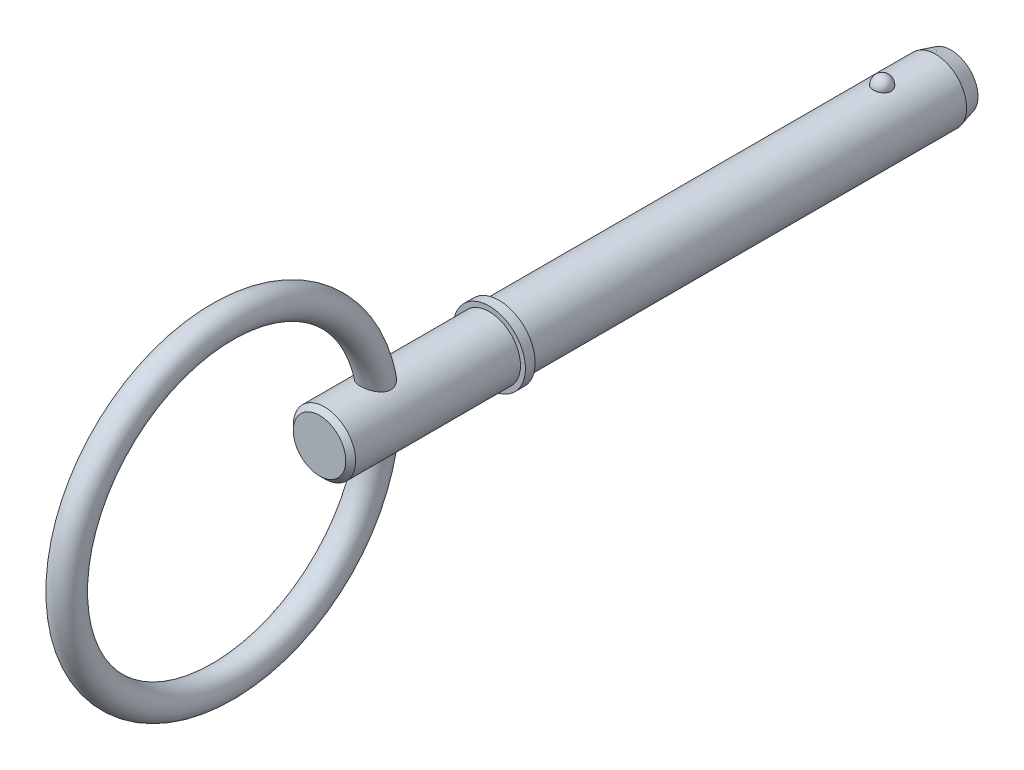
ISO-10303-21;
HEADER;
FILE_DESCRIPTION(('STEP AP214'),'2;1');
FILE_NAME('part.step','',(''),(''),'','','');
FILE_SCHEMA(('AUTOMOTIVE_DESIGN { 1 0 10303 214 1 1 1 1 }'));
ENDSEC;
DATA;
#1=APPLICATION_CONTEXT('core data for automotive mechanical design processes');
#2=APPLICATION_PROTOCOL_DEFINITION('international standard','automotive_design',2000,#1);
#3=PRODUCT_CONTEXT('',#1,'mechanical');
#4=PRODUCT('Part','Part','',(#3));
#5=PRODUCT_RELATED_PRODUCT_CATEGORY('part','',(#4));
#6=PRODUCT_DEFINITION_FORMATION('','',#4);
#7=PRODUCT_DEFINITION_CONTEXT('part definition',#1,'design');
#8=PRODUCT_DEFINITION('design','',#6,#7);
#9=PRODUCT_DEFINITION_SHAPE('','',#8);
#10=(LENGTH_UNIT() NAMED_UNIT(*) SI_UNIT(.MILLI.,.METRE.));
#11=(NAMED_UNIT(*) PLANE_ANGLE_UNIT() SI_UNIT($,.RADIAN.));
#12=(NAMED_UNIT(*) SI_UNIT($,.STERADIAN.) SOLID_ANGLE_UNIT());
#13=UNCERTAINTY_MEASURE_WITH_UNIT(LENGTH_MEASURE(1.E-05),#10,'distance_accuracy_value','');
#14=(GEOMETRIC_REPRESENTATION_CONTEXT(3) GLOBAL_UNCERTAINTY_ASSIGNED_CONTEXT((#13)) GLOBAL_UNIT_ASSIGNED_CONTEXT((#10,
#11,#12)) REPRESENTATION_CONTEXT('',''));
#15=CARTESIAN_POINT('',(0.,0.,0.));
#16=DIRECTION('',(0.,0.,1.));
#17=DIRECTION('',(1.,0.,0.));
#18=AXIS2_PLACEMENT_3D('',#15,#16,#17);
#19=CARTESIAN_POINT('',(0.,0.,38.1));
#20=DIRECTION('',(0.,0.,-1.));
#21=DIRECTION('',(-1.,0.,0.));
#22=AXIS2_PLACEMENT_3D('',#19,#20,#21);
#23=CYLINDRICAL_SURFACE('',#22,3.175);
#24=CARTESIAN_POINT('',(0.90060722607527,3.0445905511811,-0.910000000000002));
#25=CARTESIAN_POINT('',(0.90060646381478,3.04459122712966,-0.859144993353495));
#26=CARTESIAN_POINT('',(0.896466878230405,3.04582460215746,-0.808280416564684));
#27=CARTESIAN_POINT('',(0.88000740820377,3.05062019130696,-0.707994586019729));
#28=CARTESIAN_POINT('',(0.86768478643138,3.05418318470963,-0.65857382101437));
#29=CARTESIAN_POINT('',(0.835170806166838,3.06323316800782,-0.562604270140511));
#30=CARTESIAN_POINT('',(0.81498289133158,3.0687193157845,-0.516054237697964));
#31=CARTESIAN_POINT('',(0.767236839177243,3.08100268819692,-0.427093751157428));
#32=CARTESIAN_POINT('',(0.739678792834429,3.08779989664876,-0.384683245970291));
#33=CARTESIAN_POINT('',(0.677715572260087,3.10198953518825,-0.304951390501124));
#34=CARTESIAN_POINT('',(0.643275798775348,3.10938485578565,-0.267657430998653));
#35=CARTESIAN_POINT('',(0.568522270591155,3.12391647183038,-0.199446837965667));
#36=CARTESIAN_POINT('',(0.528208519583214,3.13105276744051,-0.168530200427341));
#37=CARTESIAN_POINT('',(0.442911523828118,3.14425008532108,-0.114021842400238));
#38=CARTESIAN_POINT('',(0.397942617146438,3.15031426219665,-0.0904084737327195));
#39=CARTESIAN_POINT('',(0.304493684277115,3.16071443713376,-0.0510610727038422));
#40=CARTESIAN_POINT('',(0.256014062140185,3.1650506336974,-0.0353261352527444));
#41=CARTESIAN_POINT('',(0.15789136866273,3.17144549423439,-0.012415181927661));
#42=CARTESIAN_POINT('',(0.108287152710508,3.1735453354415,-0.00508422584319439));
#43=CARTESIAN_POINT('',(0.00850701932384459,3.17538048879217,0.00133254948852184));
#44=CARTESIAN_POINT('',(-0.0416688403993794,3.17511603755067,0.00041919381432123));
#45=CARTESIAN_POINT('',(-0.140377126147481,3.17227395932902,-0.00954840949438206));
#46=CARTESIAN_POINT('',(-0.188922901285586,3.16973088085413,-0.0184810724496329));
#47=CARTESIAN_POINT('',(-0.283780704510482,3.16265029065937,-0.0440659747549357));
#48=CARTESIAN_POINT('',(-0.33009269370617,3.15811274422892,-0.060718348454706));
#49=CARTESIAN_POINT('',(-0.419493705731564,3.1474895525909,-0.101406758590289));
#50=CARTESIAN_POINT('',(-0.462561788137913,3.14139480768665,-0.125486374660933));
#51=CARTESIAN_POINT('',(-0.544042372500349,3.12831396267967,-0.180346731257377));
#52=CARTESIAN_POINT('',(-0.582454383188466,3.12132776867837,-0.211128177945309));
#53=CARTESIAN_POINT('',(-0.65437109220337,3.10705591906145,-0.279257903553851));
#54=CARTESIAN_POINT('',(-0.68776300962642,3.09976707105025,-0.316724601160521));
#55=CARTESIAN_POINT('',(-0.747869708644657,3.08581767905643,-0.396782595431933));
#56=CARTESIAN_POINT('',(-0.774583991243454,3.07915718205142,-0.439374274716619));
#57=CARTESIAN_POINT('',(-0.820959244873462,3.06712152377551,-0.529074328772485));
#58=CARTESIAN_POINT('',(-0.840531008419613,3.06176288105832,-0.576231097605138));
#59=CARTESIAN_POINT('',(-0.871672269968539,3.0530437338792,-0.673291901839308));
#60=CARTESIAN_POINT('',(-0.883242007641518,3.04968316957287,-0.723195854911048));
#61=CARTESIAN_POINT('',(-0.898057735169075,3.04535343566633,-0.824104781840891));
#62=CARTESIAN_POINT('',(-0.901339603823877,3.04437395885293,-0.875104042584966));
#63=CARTESIAN_POINT('',(-0.89960137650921,3.04488803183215,-0.976947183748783));
#64=CARTESIAN_POINT('',(-0.894581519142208,3.04638151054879,-1.02779106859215));
#65=CARTESIAN_POINT('',(-0.876414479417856,3.051656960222,-1.12760218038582));
#66=CARTESIAN_POINT('',(-0.863310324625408,3.05542681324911,-1.17657789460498));
#67=CARTESIAN_POINT('',(-0.829334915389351,3.06482253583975,-1.27156757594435));
#68=CARTESIAN_POINT('',(-0.808463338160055,3.07044848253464,-1.31758141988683));
#69=CARTESIAN_POINT('',(-0.75932502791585,3.08296842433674,-1.40563218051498));
#70=CARTESIAN_POINT('',(-0.731017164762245,3.08986940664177,-1.44764515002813));
#71=CARTESIAN_POINT('',(-0.667767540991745,3.10415201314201,-1.52624913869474));
#72=CARTESIAN_POINT('',(-0.632825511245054,3.11153365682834,-1.56283993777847));
#73=CARTESIAN_POINT('',(-0.557049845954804,3.12598962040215,-1.62972906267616));
#74=CARTESIAN_POINT('',(-0.51619336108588,3.13306260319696,-1.66000181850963));
#75=CARTESIAN_POINT('',(-0.429792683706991,3.14607829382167,-1.7132172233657));
#76=CARTESIAN_POINT('',(-0.384248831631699,3.15202108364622,-1.73616040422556));
#77=CARTESIAN_POINT('',(-0.290370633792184,3.16204171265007,-1.77380927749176));
#78=CARTESIAN_POINT('',(-0.242079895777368,3.16614263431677,-1.7886174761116));
#79=CARTESIAN_POINT('',(-0.143579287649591,3.17213528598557,-1.81001390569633));
#80=CARTESIAN_POINT('',(-0.0933696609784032,3.1740272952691,-1.81660317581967));
#81=CARTESIAN_POINT('',(0.00648182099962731,3.17537830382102,-1.82132177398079));
#82=CARTESIAN_POINT('',(0.0561153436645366,3.17488455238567,-1.81961539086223));
#83=CARTESIAN_POINT('',(0.154368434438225,3.1716260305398,-1.80816900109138));
#84=CARTESIAN_POINT('',(0.202988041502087,3.16886134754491,-1.79842930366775));
#85=CARTESIAN_POINT('',(0.297642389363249,3.16137318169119,-1.77125024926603));
#86=CARTESIAN_POINT('',(0.343686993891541,3.15665785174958,-1.75384292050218));
#87=CARTESIAN_POINT('',(0.432167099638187,3.14576631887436,-1.71181408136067));
#88=CARTESIAN_POINT('',(0.474602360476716,3.13959001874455,-1.68719209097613));
#89=CARTESIAN_POINT('',(0.555408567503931,3.1263159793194,-1.63094218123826));
#90=CARTESIAN_POINT('',(0.593703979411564,3.11920512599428,-1.59920888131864));
#91=CARTESIAN_POINT('',(0.664472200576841,3.10490064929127,-1.52981493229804));
#92=CARTESIAN_POINT('',(0.696944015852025,3.09770701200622,-1.49215327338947));
#93=CARTESIAN_POINT('',(0.755798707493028,3.08388169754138,-1.41116434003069));
#94=CARTESIAN_POINT('',(0.782059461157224,3.07726269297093,-1.36774610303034));
#95=CARTESIAN_POINT('',(0.827051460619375,3.06547790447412,-1.27699966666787));
#96=CARTESIAN_POINT('',(0.845785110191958,3.06031165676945,-1.22967272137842));
#97=CARTESIAN_POINT('',(0.873798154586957,3.05242388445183,-1.13728658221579));
#98=CARTESIAN_POINT('',(0.883833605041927,3.04951005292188,-1.09247132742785));
#99=CARTESIAN_POINT('',(0.897238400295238,3.0455931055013,-1.00177329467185));
#100=CARTESIAN_POINT('',(0.900607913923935,3.0445899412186,-0.955890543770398));
#101=CARTESIAN_POINT('',(0.90060722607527,3.0445905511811,-0.910000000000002));
#102=B_SPLINE_CURVE_WITH_KNOTS('',3,(#24,#25,#26,#27,#28,#29,#30,#31,#32,#33,#34,#35,#36,#37,
#38,#39,#40,#41,#42,#43,#44,#45,#46,#47,#48,#49,#50,#51,#52,#53,#54,#55,#56,#57,#58,#59,#60,#61,
#62,#63,#64,#65,#66,#67,#68,#69,#70,#71,#72,#73,#74,#75,#76,#77,#78,#79,#80,#81,#82,#83,#84,#85,
#86,#87,#88,#89,#90,#91,#92,#93,#94,#95,#96,#97,#98,#99,#100,#101),.UNSPECIFIED.,.T.,.F.,(4,2,2,
2,2,2,2,2,2,2,2,2,2,2,2,2,2,2,2,2,2,2,2,2,2,2,2,2,2,2,2,2,2,2,2,2,2,2,4),(0.,0.152400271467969,
0.304851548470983,0.457236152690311,0.609618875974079,0.762787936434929,0.9159569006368,
1.06866739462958,1.22136034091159,1.37119044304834,1.52100555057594,1.66858689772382,
1.81617081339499,1.9646377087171,2.1131202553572,2.26455561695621,2.41600229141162,
2.5692805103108,2.72255413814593,2.87516308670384,3.02776764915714,3.1795669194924,
3.33137249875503,3.48403607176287,3.63670583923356,3.78998198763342,3.94324701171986,
4.09453370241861,4.24580126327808,4.39408543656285,4.5423639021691,4.69002878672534,
4.83770349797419,4.9877312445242,5.13778457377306,5.29058018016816,5.44332695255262,
5.58085340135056,5.71837636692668),.UNSPECIFIED.);
#103=CARTESIAN_POINT('',(0.90060722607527,3.0445905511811,-0.910000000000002));
#104=VERTEX_POINT('',#103);
#105=EDGE_CURVE('E102',#104,#104,#102,.T.);
#106=ORIENTED_EDGE('',*,*,#105,.T.);
#107=EDGE_LOOP('',(#106));
#108=FACE_BOUND('',#107,.T.);
#109=CARTESIAN_POINT('',(0.,0.,-6.33400000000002));
#110=DIRECTION('',(0.,0.,-1.));
#111=DIRECTION('',(-1.,0.,0.));
#112=AXIS2_PLACEMENT_3D('',#109,#110,#111);
#113=CIRCLE('',#112,3.175);
#114=CARTESIAN_POINT('',(3.175,0.,-6.33400000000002));
#115=VERTEX_POINT('',#114);
#116=EDGE_CURVE('E109',#115,#115,#113,.F.);
#117=ORIENTED_EDGE('',*,*,#116,.T.);
#118=EDGE_LOOP('',(#117));
#119=FACE_BOUND('',#118,.T.);
#120=CARTESIAN_POINT('',(0.,0.,38.1));
#121=DIRECTION('',(0.,0.,1.));
#122=DIRECTION('',(1.,0.,0.));
#123=AXIS2_PLACEMENT_3D('',#120,#121,#122);
#124=CIRCLE('',#123,3.175);
#125=CARTESIAN_POINT('',(3.175,0.,38.1));
#126=VERTEX_POINT('',#125);
#127=EDGE_CURVE('E107',#126,#126,#124,.T.);
#128=ORIENTED_EDGE('',*,*,#127,.F.);
#129=EDGE_LOOP('',(#128));
#130=FACE_BOUND('',#129,.T.);
#131=ADVANCED_FACE('F39',(#108,#119,#130),#23,.T.);
#132=CARTESIAN_POINT('',(0.,0.,-7.92));
#133=DIRECTION('',(0.,0.,-1.));
#134=DIRECTION('',(-1.,0.,0.));
#135=AXIS2_PLACEMENT_3D('',#132,#133,#134);
#136=PLANE('',#135);
#137=CARTESIAN_POINT('',(0.,0.,-7.92));
#138=DIRECTION('',(0.,0.,-1.));
#139=DIRECTION('',(-1.,0.,0.));
#140=AXIS2_PLACEMENT_3D('',#137,#138,#139);
#141=CIRCLE('',#140,2.75003258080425);
#142=CARTESIAN_POINT('',(2.75003258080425,0.,-7.92));
#143=VERTEX_POINT('',#142);
#144=EDGE_CURVE('E143',#143,#143,#141,.T.);
#145=ORIENTED_EDGE('',*,*,#144,.T.);
#146=EDGE_LOOP('',(#145));
#147=FACE_BOUND('',#146,.T.);
#148=ADVANCED_FACE('F88',(#147),#136,.T.);
#149=CARTESIAN_POINT('',(0.,0.,-7.92));
#150=DIRECTION('',(0.,0.,1.));
#151=DIRECTION('',(1.,0.,0.));
#152=AXIS2_PLACEMENT_3D('',#149,#150,#151);
#153=CONICAL_SURFACE('',#152,2.75003258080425,0.26179938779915);
#154=CARTESIAN_POINT('',(3.175,0.,-6.33400000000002));
#155=CARTESIAN_POINT('',(3.17057325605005,0.,-6.35052083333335));
#156=CARTESIAN_POINT('',(3.16614651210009,0.,-6.36704166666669));
#157=CARTESIAN_POINT('',(3.15729302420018,0.,-6.40008333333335));
#158=CARTESIAN_POINT('',(3.15286628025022,0.,-6.41660416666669));
#159=CARTESIAN_POINT('',(3.14401279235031,0.,-6.44964583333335));
#160=CARTESIAN_POINT('',(3.13958604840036,0.,-6.46616666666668));
#161=CARTESIAN_POINT('',(3.13073256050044,0.,-6.49920833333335));
#162=CARTESIAN_POINT('',(3.12630581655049,0.,-6.51572916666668));
#163=CARTESIAN_POINT('',(3.11745232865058,0.,-6.54877083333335));
#164=CARTESIAN_POINT('',(3.11302558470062,0.,-6.56529166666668));
#165=CARTESIAN_POINT('',(3.10417209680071,0.,-6.59833333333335));
#166=CARTESIAN_POINT('',(3.09974535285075,0.,-6.61485416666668));
#167=CARTESIAN_POINT('',(3.09089186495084,0.,-6.64789583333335));
#168=CARTESIAN_POINT('',(3.08646512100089,0.,-6.66441666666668));
#169=CARTESIAN_POINT('',(3.07761163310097,0.,-6.69745833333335));
#170=CARTESIAN_POINT('',(3.07318488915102,0.,-6.71397916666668));
#171=CARTESIAN_POINT('',(3.06433140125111,0.,-6.74702083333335));
#172=CARTESIAN_POINT('',(3.05990465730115,0.,-6.76354166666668));
#173=CARTESIAN_POINT('',(3.05105116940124,0.,-6.79658333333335));
#174=CARTESIAN_POINT('',(3.04662442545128,0.,-6.81310416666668));
#175=CARTESIAN_POINT('',(3.03777093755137,0.,-6.84614583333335));
#176=CARTESIAN_POINT('',(3.03334419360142,0.,-6.86266666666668));
#177=CARTESIAN_POINT('',(3.0244907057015,0.,-6.89570833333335));
#178=CARTESIAN_POINT('',(3.02006396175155,0.,-6.91222916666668));
#179=CARTESIAN_POINT('',(3.01121047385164,0.,-6.94527083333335));
#180=CARTESIAN_POINT('',(3.00678372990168,0.,-6.96179166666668));
#181=CARTESIAN_POINT('',(2.99793024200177,0.,-6.99483333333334));
#182=CARTESIAN_POINT('',(2.99350349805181,0.,-7.01135416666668));
#183=CARTESIAN_POINT('',(2.9846500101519,0.,-7.04439583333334));
#184=CARTESIAN_POINT('',(2.98022326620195,0.,-7.06091666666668));
#185=CARTESIAN_POINT('',(2.97136977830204,0.,-7.09395833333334));
#186=CARTESIAN_POINT('',(2.96694303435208,0.,-7.11047916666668));
#187=CARTESIAN_POINT('',(2.95808954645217,0.,-7.14352083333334));
#188=CARTESIAN_POINT('',(2.95366280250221,0.,-7.16004166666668));
#189=CARTESIAN_POINT('',(2.9448093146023,0.,-7.19308333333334));
#190=CARTESIAN_POINT('',(2.94038257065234,0.,-7.20960416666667));
#191=CARTESIAN_POINT('',(2.93152908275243,0.,-7.24264583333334));
#192=CARTESIAN_POINT('',(2.92710233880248,0.,-7.25916666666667));
#193=CARTESIAN_POINT('',(2.91824885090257,0.,-7.29220833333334));
#194=CARTESIAN_POINT('',(2.91382210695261,0.,-7.30872916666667));
#195=CARTESIAN_POINT('',(2.9049686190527,0.,-7.34177083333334));
#196=CARTESIAN_POINT('',(2.90054187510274,0.,-7.35829166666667));
#197=CARTESIAN_POINT('',(2.89168838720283,0.,-7.39133333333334));
#198=CARTESIAN_POINT('',(2.88726164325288,0.,-7.40785416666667));
#199=CARTESIAN_POINT('',(2.87840815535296,0.,-7.44089583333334));
#200=CARTESIAN_POINT('',(2.87398141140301,0.,-7.45741666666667));
#201=CARTESIAN_POINT('',(2.8651279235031,0.,-7.49045833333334));
#202=CARTESIAN_POINT('',(2.86070117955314,0.,-7.50697916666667));
#203=CARTESIAN_POINT('',(2.85184769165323,0.,-7.54002083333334));
#204=CARTESIAN_POINT('',(2.84742094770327,0.,-7.55654166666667));
#205=CARTESIAN_POINT('',(2.83856745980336,0.,-7.58958333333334));
#206=CARTESIAN_POINT('',(2.83414071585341,0.,-7.60610416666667));
#207=CARTESIAN_POINT('',(2.82528722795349,0.,-7.63914583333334));
#208=CARTESIAN_POINT('',(2.82086048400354,0.,-7.65566666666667));
#209=CARTESIAN_POINT('',(2.81200699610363,0.,-7.68870833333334));
#210=CARTESIAN_POINT('',(2.80758025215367,0.,-7.70522916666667));
#211=CARTESIAN_POINT('',(2.79872676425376,0.,-7.73827083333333));
#212=CARTESIAN_POINT('',(2.7943000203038,0.,-7.75479166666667));
#213=CARTESIAN_POINT('',(2.78544653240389,0.,-7.78783333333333));
#214=CARTESIAN_POINT('',(2.78101978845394,0.,-7.80435416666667));
#215=CARTESIAN_POINT('',(2.77216630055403,0.,-7.83739583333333));
#216=CARTESIAN_POINT('',(2.76773955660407,0.,-7.85391666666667));
#217=CARTESIAN_POINT('',(2.75888606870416,0.,-7.88695833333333));
#218=CARTESIAN_POINT('',(2.7544593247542,0.,-7.90347916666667));
#219=CARTESIAN_POINT('',(2.75003258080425,0.,-7.92));
#220=B_SPLINE_CURVE_WITH_KNOTS('',3,(#154,#155,#156,#157,#158,#159,#160,#161,#162,#163,#164,
#165,#166,#167,#168,#169,#170,#171,#172,#173,#174,#175,#176,#177,#178,#179,#180,#181,#182,#183,
#184,#185,#186,#187,#188,#189,#190,#191,#192,#193,#194,#195,#196,#197,#198,#199,#200,#201,#202,
#203,#204,#205,#206,#207,#208,#209,#210,#211,#212,#213,#214,#215,#216,#217,#218,#219),
.UNSPECIFIED.,.F.,.F.,(4,2,2,2,2,2,2,2,2,2,2,2,2,2,2,2,2,2,2,2,2,2,2,2,2,2,2,2,2,2,2,2,4),(0.,
0.051310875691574,0.102621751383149,0.153932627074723,0.205243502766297,0.256554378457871,
0.307865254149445,0.359176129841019,0.410487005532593,0.461797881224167,0.513108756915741,
0.564419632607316,0.61573050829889,0.667041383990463,0.718352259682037,0.769663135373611,
0.820974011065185,0.872284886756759,0.923595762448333,0.974906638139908,1.02621751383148,
1.07752838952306,1.12883926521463,1.1801501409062,1.23146101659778,1.28277189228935,
1.33408276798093,1.3853936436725,1.43670451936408,1.48801539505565,1.53932627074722,
1.5906371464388,1.64194802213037),.UNSPECIFIED.);
#221=EDGE_CURVE('BSEAM94',#115,#143,#220,.T.);
#222=ORIENTED_EDGE('',*,*,#116,.F.);
#223=ORIENTED_EDGE('',*,*,#144,.F.);
#224=ORIENTED_EDGE('',*,*,#221,.T.);
#225=ORIENTED_EDGE('',*,*,#221,.F.);
#226=EDGE_LOOP('',(#222,#224,#223,#225));
#227=FACE_BOUND('',#226,.T.);
#228=ADVANCED_FACE('F94',(#227),#153,.T.);
#229=CARTESIAN_POINT('',(0.,3.175,-0.910000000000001));
#230=DIRECTION('',(0.,1.,0.));
#231=DIRECTION('',(0.,0.,-1.));
#232=AXIS2_PLACEMENT_3D('',#229,#230,#231);
#233=SPHERICAL_SURFACE('',#232,0.91);
#234=ORIENTED_EDGE('',*,*,#105,.F.);
#235=EDGE_LOOP('',(#234));
#236=FACE_BOUND('',#235,.T.);
#237=ADVANCED_FACE('F112',(#236),#233,.T.);
#238=CARTESIAN_POINT('',(0.,0.,38.1));
#239=DIRECTION('',(0.,0.,-1.));
#240=DIRECTION('',(-1.,0.,0.));
#241=AXIS2_PLACEMENT_3D('',#238,#239,#240);
#242=PLANE('',#241);
#243=ORIENTED_EDGE('',*,*,#127,.T.);
#244=EDGE_LOOP('',(#243));
#245=FACE_BOUND('',#244,.T.);
#246=CARTESIAN_POINT('',(0.,0.,38.1));
#247=DIRECTION('',(0.,0.,-1.));
#248=DIRECTION('',(-1.,0.,0.));
#249=AXIS2_PLACEMENT_3D('',#246,#247,#248);
#250=CIRCLE('',#249,3.675);
#251=CARTESIAN_POINT('',(-3.675,0.,38.1));
#252=VERTEX_POINT('',#251);
#253=EDGE_CURVE('E108',#252,#252,#250,.T.);
#254=ORIENTED_EDGE('',*,*,#253,.T.);
#255=EDGE_LOOP('',(#254));
#256=FACE_BOUND('',#255,.T.);
#257=ADVANCED_FACE('F116',(#245,#256),#242,.T.);
#258=CARTESIAN_POINT('',(0.,0.,33.7287874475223));
#259=DIRECTION('',(0.,0.,-1.));
#260=DIRECTION('',(-1.,0.,0.));
#261=AXIS2_PLACEMENT_3D('',#258,#259,#260);
#262=CYLINDRICAL_SURFACE('',#261,3.675);
#263=CARTESIAN_POINT('',(0.,0.,39.1));
#264=DIRECTION('',(0.,0.,-1.));
#265=DIRECTION('',(-1.,0.,0.));
#266=AXIS2_PLACEMENT_3D('',#263,#264,#265);
#267=CIRCLE('',#266,3.675);
#268=CARTESIAN_POINT('',(-3.675,0.,39.1));
#269=VERTEX_POINT('',#268);
#270=EDGE_CURVE('E133',#269,#269,#267,.T.);
#271=ORIENTED_EDGE('',*,*,#270,.T.);
#272=EDGE_LOOP('',(#271));
#273=FACE_BOUND('',#272,.T.);
#274=ORIENTED_EDGE('',*,*,#253,.F.);
#275=EDGE_LOOP('',(#274));
#276=FACE_BOUND('',#275,.T.);
#277=ADVANCED_FACE('F120',(#273,#276),#262,.T.);
#278=CARTESIAN_POINT('',(0.,3.675,39.1));
#279=DIRECTION('',(0.,0.,1.));
#280=DIRECTION('',(1.,0.,0.));
#281=AXIS2_PLACEMENT_3D('',#278,#279,#280);
#282=PLANE('',#281);
#283=CARTESIAN_POINT('',(0.,0.,39.1));
#284=DIRECTION('',(0.,0.,1.));
#285=DIRECTION('',(1.,0.,0.));
#286=AXIS2_PLACEMENT_3D('',#283,#284,#285);
#287=CIRCLE('',#286,3.175);
#288=CARTESIAN_POINT('',(3.175,0.,39.1));
#289=VERTEX_POINT('',#288);
#290=EDGE_CURVE('E111',#289,#289,#287,.T.);
#291=ORIENTED_EDGE('',*,*,#290,.F.);
#292=EDGE_LOOP('',(#291));
#293=FACE_BOUND('',#292,.T.);
#294=ORIENTED_EDGE('',*,*,#270,.F.);
#295=EDGE_LOOP('',(#294));
#296=FACE_BOUND('',#295,.T.);
#297=ADVANCED_FACE('F85',(#293,#296),#282,.T.);
#298=CARTESIAN_POINT('',(0.,0.,56.39));
#299=DIRECTION('',(0.,0.,-1.));
#300=DIRECTION('',(-1.,0.,0.));
#301=AXIS2_PLACEMENT_3D('',#298,#299,#300);
#302=CYLINDRICAL_SURFACE('',#301,3.175);
#303=CARTESIAN_POINT('',(-0.793622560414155,-3.07421343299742,49.3949618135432));
#304=CARTESIAN_POINT('',(-0.723928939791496,-3.09220199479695,49.3540743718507));
#305=CARTESIAN_POINT('',(-0.65053758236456,-3.10860299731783,49.3186572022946));
#306=CARTESIAN_POINT('',(-0.498225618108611,-3.13662262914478,49.25960803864));
#307=CARTESIAN_POINT('',(-0.41929921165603,-3.14823615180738,49.235988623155));
#308=CARTESIAN_POINT('',(-0.258022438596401,-3.16553731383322,49.2011787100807));
#309=CARTESIAN_POINT('',(-0.175668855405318,-3.17121924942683,49.1900001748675));
#310=CARTESIAN_POINT('',(-0.0100583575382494,-3.17606405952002,49.1804538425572));
#311=CARTESIAN_POINT('',(0.0731982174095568,-3.17522930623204,49.1820813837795));
#312=CARTESIAN_POINT('',(0.236345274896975,-3.16722178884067,49.1979075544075));
#313=CARTESIAN_POINT('',(0.31626956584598,-3.16018772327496,49.2118310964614));
#314=CARTESIAN_POINT('',(0.472429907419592,-3.14064183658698,49.2514871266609));
#315=CARTESIAN_POINT('',(0.548665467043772,-3.12812928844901,49.2772211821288));
#316=CARTESIAN_POINT('',(0.696533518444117,-3.0985857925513,49.3403145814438));
#317=CARTESIAN_POINT('',(0.768085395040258,-3.08149328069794,49.3778336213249));
#318=CARTESIAN_POINT('',(0.903666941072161,-3.04449595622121,49.463584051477));
#319=CARTESIAN_POINT('',(0.967693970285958,-3.02459016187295,49.5118191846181));
#320=CARTESIAN_POINT('',(1.08889306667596,-2.98315111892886,49.620085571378));
#321=CARTESIAN_POINT('',(1.14572430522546,-2.96158491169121,49.6804869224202));
#322=CARTESIAN_POINT('',(1.24806454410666,-2.91993487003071,49.8106874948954));
#323=CARTESIAN_POINT('',(1.29357550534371,-2.89985077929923,49.8804850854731));
#324=CARTESIAN_POINT('',(1.37094214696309,-2.86407549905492,50.0262600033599));
#325=CARTESIAN_POINT('',(1.40307792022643,-2.84829687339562,50.1020662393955));
#326=CARTESIAN_POINT('',(1.45397574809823,-2.82265933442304,50.2589553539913));
#327=CARTESIAN_POINT('',(1.47274938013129,-2.81279529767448,50.3400335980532));
#328=CARTESIAN_POINT('',(1.49549698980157,-2.80076108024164,50.4979026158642));
#329=CARTESIAN_POINT('',(1.50056337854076,-2.79802369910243,50.5744958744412));
#330=CARTESIAN_POINT('',(1.49933665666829,-2.79868066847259,50.7275541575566));
#331=CARTESIAN_POINT('',(1.49304097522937,-2.80207640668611,50.8040191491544));
#332=CARTESIAN_POINT('',(1.46976618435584,-2.81435249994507,50.9552802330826));
#333=CARTESIAN_POINT('',(1.45272287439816,-2.82326580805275,51.0300634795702));
#334=CARTESIAN_POINT('',(1.40884990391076,-2.84541139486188,51.1760088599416));
#335=CARTESIAN_POINT('',(1.38201642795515,-2.85864535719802,51.2471695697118));
#336=CARTESIAN_POINT('',(1.31496449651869,-2.89016475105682,51.3946079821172));
#337=CARTESIAN_POINT('',(1.27338339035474,-2.90890132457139,51.4701693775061));
#338=CARTESIAN_POINT('',(1.17952729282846,-2.94820796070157,51.6139034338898));
#339=CARTESIAN_POINT('',(1.12723913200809,-2.96878026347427,51.6820668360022));
#340=CARTESIAN_POINT('',(1.00570728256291,-3.01228109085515,51.8173106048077));
#341=CARTESIAN_POINT('',(0.935174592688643,-3.03519170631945,51.8832498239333));
#342=CARTESIAN_POINT('',(0.78260575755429,-3.07805054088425,52.001321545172));
#343=CARTESIAN_POINT('',(0.70058894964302,-3.09800362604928,52.0534768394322));
#344=CARTESIAN_POINT('',(0.549003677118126,-3.12787153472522,52.1296423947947));
#345=CARTESIAN_POINT('',(0.481582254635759,-3.1390487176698,52.1574376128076));
#346=CARTESIAN_POINT('',(0.34269622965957,-3.15722518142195,52.2021563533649));
#347=CARTESIAN_POINT('',(0.271235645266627,-3.16422853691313,52.2190904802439));
#348=CARTESIAN_POINT('',(0.125873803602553,-3.17334230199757,52.2410622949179));
#349=CARTESIAN_POINT('',(0.0519637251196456,-3.17543249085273,52.2460508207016));
#350=CARTESIAN_POINT('',(-0.0956207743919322,-3.17441743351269,52.2436180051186));
#351=CARTESIAN_POINT('',(-0.169295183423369,-3.1713119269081,52.2361960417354));
#352=CARTESIAN_POINT('',(-0.30944934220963,-3.1606169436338,52.2103375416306));
#353=CARTESIAN_POINT('',(-0.376089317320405,-3.15332372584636,52.1926279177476));
#354=CARTESIAN_POINT('',(-0.505583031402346,-3.13517004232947,52.1477876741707));
#355=CARTESIAN_POINT('',(-0.568435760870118,-3.12430863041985,52.1206545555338));
#356=CARTESIAN_POINT('',(-0.69430644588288,-3.09887452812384,52.0555626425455));
#357=CARTESIAN_POINT('',(-0.756907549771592,-3.08406907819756,52.0168937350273));
#358=CARTESIAN_POINT('',(-0.8756456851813,-3.05248288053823,51.9313455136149));
#359=CARTESIAN_POINT('',(-0.931779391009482,-3.03570112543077,51.8844620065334));
#360=CARTESIAN_POINT('',(-1.0463923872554,-2.99832170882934,51.7747926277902));
#361=CARTESIAN_POINT('',(-1.10353654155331,-2.97757338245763,51.7106605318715));
#362=CARTESIAN_POINT('',(-1.20755858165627,-2.93692907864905,51.5742268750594));
#363=CARTESIAN_POINT('',(-1.25442453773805,-2.91703411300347,51.5019159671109));
#364=CARTESIAN_POINT('',(-1.34199791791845,-2.87788786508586,51.3412794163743));
#365=CARTESIAN_POINT('',(-1.38127718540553,-2.8590047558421,51.2520744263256));
#366=CARTESIAN_POINT('',(-1.44406659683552,-2.82781619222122,51.0671839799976));
#367=CARTESIAN_POINT('',(-1.46759319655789,-2.81550387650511,50.9715054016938));
#368=CARTESIAN_POINT('',(-1.49571801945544,-2.8006591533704,50.7845771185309));
#369=CARTESIAN_POINT('',(-1.50169726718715,-2.79741422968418,50.693598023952));
#370=CARTESIAN_POINT('',(-1.49747735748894,-2.79967890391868,50.5121564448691));
#371=CARTESIAN_POINT('',(-1.48729863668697,-2.80517744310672,50.4216934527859));
#372=CARTESIAN_POINT('',(-1.45348639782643,-2.82281521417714,50.2584626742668));
#373=CARTESIAN_POINT('',(-1.43212237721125,-2.83382344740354,50.185088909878));
#374=CARTESIAN_POINT('',(-1.37828411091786,-2.86039426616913,50.0433903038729));
#375=CARTESIAN_POINT('',(-1.34580440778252,-2.87595908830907,49.9750679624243));
#376=CARTESIAN_POINT('',(-1.27066760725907,-2.90993532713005,49.8450336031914));
#377=CARTESIAN_POINT('',(-1.22800357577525,-2.9283486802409,49.783326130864));
#378=CARTESIAN_POINT('',(-1.13363307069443,-2.96615489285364,49.6677083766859));
#379=CARTESIAN_POINT('',(-1.08193541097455,-2.98554678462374,49.6137905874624));
#380=CARTESIAN_POINT('',(-0.990573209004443,-3.01675653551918,49.5323094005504));
#381=CARTESIAN_POINT('',(-0.953209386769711,-3.02880489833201,49.5022130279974));
#382=CARTESIAN_POINT('',(-0.875544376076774,-3.05216210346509,49.4457477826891));
#383=CARTESIAN_POINT('',(-0.835242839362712,-3.06347085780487,49.4193793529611));
#384=CARTESIAN_POINT('',(-0.793622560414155,-3.07421343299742,49.3949618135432));
#385=B_SPLINE_CURVE_WITH_KNOTS('',3,(#303,#304,#305,#306,#307,#308,#309,#310,#311,#312,#313,
#314,#315,#316,#317,#318,#319,#320,#321,#322,#323,#324,#325,#326,#327,#328,#329,#330,#331,#332,
#333,#334,#335,#336,#337,#338,#339,#340,#341,#342,#343,#344,#345,#346,#347,#348,#349,#350,#351,
#352,#353,#354,#355,#356,#357,#358,#359,#360,#361,#362,#363,#364,#365,#366,#367,#368,#369,#370,
#371,#372,#373,#374,#375,#376,#377,#378,#379,#380,#381,#382,#383,#384),.UNSPECIFIED.,.T.,.F.,(4,
2,2,2,2,2,2,2,2,2,2,2,2,2,2,2,2,2,2,2,2,2,2,2,2,2,2,2,2,2,2,2,2,2,2,2,2,2,2,2,4),(0.,
0.248167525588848,0.496599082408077,0.745269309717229,0.993849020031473,1.23700449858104,
1.48019225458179,1.72682894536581,1.97355191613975,2.22939388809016,2.48519151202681,
2.73532416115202,2.98523982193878,3.2145541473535,3.44392036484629,3.67466984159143,
3.90550934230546,4.16925064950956,4.43331832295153,4.7295197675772,5.02522832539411,
5.24564983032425,5.46585579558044,5.68696647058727,5.9080882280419,6.11521387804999,
6.32239449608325,6.54672206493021,6.77116447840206,7.03522663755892,7.29959368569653,
7.59590092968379,7.89189815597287,8.16387683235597,8.43551178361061,8.66603557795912,
8.89667271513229,9.12746733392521,9.35803801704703,9.50622339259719,9.6544263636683),.UNSPECIFIED.);
#386=CARTESIAN_POINT('',(-0.793622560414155,-3.07421343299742,49.3949618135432));
#387=VERTEX_POINT('',#386);
#388=EDGE_CURVE('E10',#387,#387,#385,.T.);
#389=ORIENTED_EDGE('',*,*,#388,.F.);
#390=EDGE_LOOP('',(#389));
#391=FACE_BOUND('',#390,.T.);
#392=CARTESIAN_POINT('',(-0.793622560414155,3.07421343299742,49.3949618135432));
#393=CARTESIAN_POINT('',(-0.86460683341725,3.05588589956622,49.4366128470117));
#394=CARTESIAN_POINT('',(-0.931875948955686,3.03587991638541,49.4840114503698));
#395=CARTESIAN_POINT('',(-1.05725170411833,2.99453227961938,49.5893775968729));
#396=CARTESIAN_POINT('',(-1.11534118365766,2.97318822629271,49.6473645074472));
#397=CARTESIAN_POINT('',(-1.22080462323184,2.93146441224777,49.772887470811));
#398=CARTESIAN_POINT('',(-1.26816209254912,2.91108617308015,49.8404379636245));
#399=CARTESIAN_POINT('',(-1.35052787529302,2.87380473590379,49.9835086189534));
#400=CARTESIAN_POINT('',(-1.38554886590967,2.856897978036,50.0590204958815));
#401=CARTESIAN_POINT('',(-1.44074287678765,2.82945202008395,50.2122947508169));
#402=CARTESIAN_POINT('',(-1.46153301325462,2.81865228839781,50.2897872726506));
#403=CARTESIAN_POINT('',(-1.49023441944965,2.80358650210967,50.4477206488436));
#404=CARTESIAN_POINT('',(-1.49815016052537,2.79931817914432,50.5281604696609));
#405=CARTESIAN_POINT('',(-1.50117056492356,2.79769676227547,50.6840076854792));
#406=CARTESIAN_POINT('',(-1.49708260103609,2.79990784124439,50.7593985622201));
#407=CARTESIAN_POINT('',(-1.47846985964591,2.80977909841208,50.9084983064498));
#408=CARTESIAN_POINT('',(-1.46394166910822,2.8174410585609,50.9822066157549));
#409=CARTESIAN_POINT('',(-1.42400377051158,2.83784609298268,51.1313443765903));
#410=CARTESIAN_POINT('',(-1.39791960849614,2.85090002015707,51.2065484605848));
#411=CARTESIAN_POINT('',(-1.33585690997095,2.8805017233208,51.3520384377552));
#412=CARTESIAN_POINT('',(-1.29987052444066,2.89705226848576,51.4223203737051));
#413=CARTESIAN_POINT('',(-1.21229019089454,2.93489412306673,51.5677405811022));
#414=CARTESIAN_POINT('',(-1.15911759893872,2.95651988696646,51.6418449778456));
#415=CARTESIAN_POINT('',(-1.04143166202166,2.99999612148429,51.7803805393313));
#416=CARTESIAN_POINT('',(-0.976918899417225,3.0218465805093,51.844812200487));
#417=CARTESIAN_POINT('',(-0.845368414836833,3.06106710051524,51.9552302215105));
#418=CARTESIAN_POINT('',(-0.779466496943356,3.0786636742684,52.0024840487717));
#419=CARTESIAN_POINT('',(-0.640261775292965,3.11059085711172,52.0859540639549));
#420=CARTESIAN_POINT('',(-0.566963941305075,3.12492363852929,52.1221775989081));
#421=CARTESIAN_POINT('',(-0.413802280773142,3.14887886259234,52.1818109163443));
#422=CARTESIAN_POINT('',(-0.333888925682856,3.15846114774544,52.2051116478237));
#423=CARTESIAN_POINT('',(-0.170660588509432,3.17146222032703,52.2365717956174));
#424=CARTESIAN_POINT('',(-0.087349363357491,3.17488763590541,52.2447474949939));
#425=CARTESIAN_POINT('',(0.0674621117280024,3.17509166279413,52.2452317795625));
#426=CARTESIAN_POINT('',(0.138963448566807,3.17274321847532,52.2396242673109));
#427=CARTESIAN_POINT('',(0.2798552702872,3.16342998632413,52.2171581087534));
#428=CARTESIAN_POINT('',(0.349245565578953,3.15646478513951,52.2002984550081));
#429=CARTESIAN_POINT('',(0.483013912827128,3.13875920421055,52.1567119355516));
#430=CARTESIAN_POINT('',(0.547455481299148,3.12808257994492,52.1301513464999));
#431=CARTESIAN_POINT('',(0.671431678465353,3.10383639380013,52.0683782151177));
#432=CARTESIAN_POINT('',(0.73096479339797,3.09026594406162,52.0331630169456));
#433=CARTESIAN_POINT('',(0.852308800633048,3.05919023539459,51.9498716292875));
#434=CARTESIAN_POINT('',(0.913284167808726,3.04140021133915,51.9006877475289));
#435=CARTESIAN_POINT('',(1.0273242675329,3.00480015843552,51.7941850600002));
#436=CARTESIAN_POINT('',(1.08038247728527,2.98598930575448,51.7368596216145));
#437=CARTESIAN_POINT('',(1.18657794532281,2.94557646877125,51.6046952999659));
#438=CARTESIAN_POINT('',(1.23812372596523,2.92405810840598,51.5285445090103));
#439=CARTESIAN_POINT('',(1.32862928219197,2.88406370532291,51.3682796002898));
#440=CARTESIAN_POINT('',(1.36758013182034,2.86558982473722,51.2841598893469));
#441=CARTESIAN_POINT('',(1.43274280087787,2.83359383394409,51.1061421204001));
#442=CARTESIAN_POINT('',(1.45837682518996,2.82030175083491,51.0119863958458));
#443=CARTESIAN_POINT('',(1.49241322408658,2.80245006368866,50.8198495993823));
#444=CARTESIAN_POINT('',(1.50084951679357,2.79787327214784,50.7218764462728));
#445=CARTESIAN_POINT('',(1.49914798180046,2.79877932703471,50.5405073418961));
#446=CARTESIAN_POINT('',(1.49154990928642,2.80288682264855,50.457078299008));
#447=CARTESIAN_POINT('',(1.46253136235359,2.81813655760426,50.2933228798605));
#448=CARTESIAN_POINT('',(1.44111368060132,2.82927737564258,50.2129958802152));
#449=CARTESIAN_POINT('',(1.38785163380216,2.85574398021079,50.0657200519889));
#450=CARTESIAN_POINT('',(1.3572264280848,2.87055627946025,49.9982302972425));
#451=CARTESIAN_POINT('',(1.28612163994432,2.90310901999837,49.8694446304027));
#452=CARTESIAN_POINT('',(1.24564038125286,2.92084995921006,49.808149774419));
#453=CARTESIAN_POINT('',(1.15320825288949,2.95860856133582,49.6894756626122));
#454=CARTESIAN_POINT('',(1.1007254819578,2.97869868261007,49.6325343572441));
#455=CARTESIAN_POINT('',(0.987118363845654,3.01825121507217,49.5277702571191));
#456=CARTESIAN_POINT('',(0.925990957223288,3.03771340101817,49.4799507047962));
#457=CARTESIAN_POINT('',(0.792065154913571,3.07545294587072,49.3913571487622));
#458=CARTESIAN_POINT('',(0.718757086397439,3.0935612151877,49.3512781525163));
#459=CARTESIAN_POINT('',(0.565747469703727,3.12516438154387,49.2833730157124));
#460=CARTESIAN_POINT('',(0.486046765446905,3.1386598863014,49.2555452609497));
#461=CARTESIAN_POINT('',(0.323293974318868,3.15955163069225,49.2130890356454));
#462=CARTESIAN_POINT('',(0.240283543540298,3.16700771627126,49.1983309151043));
#463=CARTESIAN_POINT('',(0.0726303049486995,3.17527774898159,49.1819853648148));
#464=CARTESIAN_POINT('',(-0.0120126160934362,3.17609123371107,49.1803988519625));
#465=CARTESIAN_POINT('',(-0.177340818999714,3.17108555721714,49.1902649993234));
#466=CARTESIAN_POINT('',(-0.258061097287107,3.16549698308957,49.2012643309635));
#467=CARTESIAN_POINT('',(-0.416230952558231,3.1486007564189,49.2352506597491));
#468=CARTESIAN_POINT('',(-0.493684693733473,3.13730063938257,49.2582218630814));
#469=CARTESIAN_POINT('',(-0.607599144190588,3.11657538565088,49.301836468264));
#470=CARTESIAN_POINT('',(-0.645999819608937,3.10882447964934,49.3183691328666));
#471=CARTESIAN_POINT('',(-0.721122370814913,3.092262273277,49.3544352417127));
#472=CARTESIAN_POINT('',(-0.757844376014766,3.08345105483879,49.3739684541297));
#473=CARTESIAN_POINT('',(-0.793622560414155,3.07421343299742,49.3949618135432));
#474=B_SPLINE_CURVE_WITH_KNOTS('',3,(#392,#393,#394,#395,#396,#397,#398,#399,#400,#401,#402,
#403,#404,#405,#406,#407,#408,#409,#410,#411,#412,#413,#414,#415,#416,#417,#418,#419,#420,#421,
#422,#423,#424,#425,#426,#427,#428,#429,#430,#431,#432,#433,#434,#435,#436,#437,#438,#439,#440,
#441,#442,#443,#444,#445,#446,#447,#448,#449,#450,#451,#452,#453,#454,#455,#456,#457,#458,#459,
#460,#461,#462,#463,#464,#465,#466,#467,#468,#469,#470,#471,#472,#473),.UNSPECIFIED.,.T.,.F.,(4,
2,2,2,2,2,2,2,2,2,2,2,2,2,2,2,2,2,2,2,2,2,2,2,2,2,2,2,2,2,2,2,2,2,2,2,2,2,2,2,4),(0.,
0.252800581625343,0.506068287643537,0.759722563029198,1.01311541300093,1.25467278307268,
1.49614624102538,1.72175790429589,1.94744335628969,2.18851823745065,2.4297847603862,
2.7098131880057,2.98982723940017,3.23776482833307,3.48553690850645,3.73536921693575,
3.98493240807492,4.19913817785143,4.41336312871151,4.62407643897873,4.83485449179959,
5.07495869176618,5.31525962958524,5.59735778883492,5.87965543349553,6.17335015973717,
6.46646508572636,6.71664398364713,6.96677234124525,7.19253107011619,7.41832822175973,
7.65731660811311,7.8963897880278,8.15162793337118,8.40683243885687,8.65947601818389,
8.91213718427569,9.15597668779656,9.39949531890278,9.52692416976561,9.65434318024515),.UNSPECIFIED.);
#475=CARTESIAN_POINT('',(-0.793622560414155,3.07421343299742,49.3949618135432));
#476=VERTEX_POINT('',#475);
#477=EDGE_CURVE('E51',#476,#476,#474,.T.);
#478=ORIENTED_EDGE('',*,*,#477,.F.);
#479=EDGE_LOOP('',(#478));
#480=FACE_BOUND('',#479,.T.);
#481=CARTESIAN_POINT('',(0.,0.,55.89));
#482=DIRECTION('',(0.,0.,-1.));
#483=DIRECTION('',(-1.,0.,0.));
#484=AXIS2_PLACEMENT_3D('',#481,#482,#483);
#485=CIRCLE('',#484,3.175);
#486=CARTESIAN_POINT('',(-3.175,0.,55.89));
#487=VERTEX_POINT('',#486);
#488=EDGE_CURVE('E64',#487,#487,#485,.T.);
#489=ORIENTED_EDGE('',*,*,#488,.T.);
#490=EDGE_LOOP('',(#489));
#491=FACE_BOUND('',#490,.T.);
#492=ORIENTED_EDGE('',*,*,#290,.T.);
#493=EDGE_LOOP('',(#492));
#494=FACE_BOUND('',#493,.T.);
#495=ADVANCED_FACE('F69',(#391,#480,#491,#494),#302,.T.);
#496=CARTESIAN_POINT('',(0.,0.,56.39));
#497=DIRECTION('',(0.,0.,-1.));
#498=DIRECTION('',(-1.,0.,0.));
#499=AXIS2_PLACEMENT_3D('',#496,#497,#498);
#500=PLANE('',#499);
#501=CARTESIAN_POINT('',(0.,0.,56.39));
#502=DIRECTION('',(0.,0.,-1.));
#503=DIRECTION('',(-1.,0.,0.));
#504=AXIS2_PLACEMENT_3D('',#501,#502,#503);
#505=CIRCLE('',#504,2.67500000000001);
#506=CARTESIAN_POINT('',(-2.67500000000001,0.,56.39));
#507=VERTEX_POINT('',#506);
#508=EDGE_CURVE('E58',#507,#507,#505,.F.);
#509=ORIENTED_EDGE('',*,*,#508,.T.);
#510=EDGE_LOOP('',(#509));
#511=FACE_BOUND('',#510,.T.);
#512=ADVANCED_FACE('F76',(#511),#500,.F.);
#513=CARTESIAN_POINT('',(0.,0.,55.89));
#514=DIRECTION('',(0.,0.,-1.));
#515=DIRECTION('',(-1.,0.,0.));
#516=AXIS2_PLACEMENT_3D('',#513,#514,#515);
#517=CONICAL_SURFACE('',#516,3.175,0.785398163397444);
#518=ORIENTED_EDGE('',*,*,#508,.F.);
#519=EDGE_LOOP('',(#518));
#520=FACE_BOUND('',#519,.T.);
#521=ORIENTED_EDGE('',*,*,#488,.F.);
#522=EDGE_LOOP('',(#521));
#523=FACE_BOUND('',#522,.T.);
#524=ADVANCED_FACE('F41',(#520,#523),#517,.T.);
#525=CARTESIAN_POINT('',(0.,0.,66.265));
#526=DIRECTION('',(1.,0.,0.));
#527=DIRECTION('',(0.,0.,-1.));
#528=AXIS2_PLACEMENT_3D('',#525,#526,#527);
#529=TOROIDAL_SURFACE('',#528,15.875,1.5);
#530=ORIENTED_EDGE('',*,*,#388,.T.);
#531=EDGE_LOOP('',(#530));
#532=FACE_BOUND('',#531,.T.);
#533=ORIENTED_EDGE('',*,*,#477,.T.);
#534=EDGE_LOOP('',(#533));
#535=FACE_BOUND('',#534,.T.);
#536=ADVANCED_FACE('F73',(#532,#535),#529,.T.);
#537=CLOSED_SHELL('',(#131,#148,#228,#237,#257,#277,#297,#495,#512,#524,#536));
#538=MANIFOLD_SOLID_BREP('B2',#537);
#539=ADVANCED_BREP_SHAPE_REPRESENTATION('',(#18,#538),#14);
#540=SHAPE_DEFINITION_REPRESENTATION(#9,#539);
ENDSEC;
END-ISO-10303-21;
